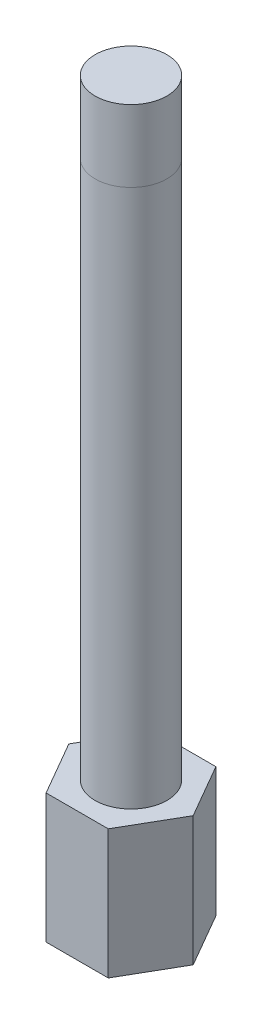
ISO-10303-21;
HEADER;
FILE_DESCRIPTION(('STEP AP214'),'2;1');
FILE_NAME('part.step','',(''),(''),'','','');
FILE_SCHEMA(('AUTOMOTIVE_DESIGN { 1 0 10303 214 1 1 1 1 }'));
ENDSEC;
DATA;
#1=APPLICATION_CONTEXT('core data for automotive mechanical design processes');
#2=APPLICATION_PROTOCOL_DEFINITION('international standard','automotive_design',2000,#1);
#3=PRODUCT_CONTEXT('',#1,'mechanical');
#4=PRODUCT('Part','Part','',(#3));
#5=PRODUCT_RELATED_PRODUCT_CATEGORY('part','',(#4));
#6=PRODUCT_DEFINITION_FORMATION('','',#4);
#7=PRODUCT_DEFINITION_CONTEXT('part definition',#1,'design');
#8=PRODUCT_DEFINITION('design','',#6,#7);
#9=PRODUCT_DEFINITION_SHAPE('','',#8);
#10=(LENGTH_UNIT() NAMED_UNIT(*) SI_UNIT(.MILLI.,.METRE.));
#11=(NAMED_UNIT(*) PLANE_ANGLE_UNIT() SI_UNIT($,.RADIAN.));
#12=(NAMED_UNIT(*) SI_UNIT($,.STERADIAN.) SOLID_ANGLE_UNIT());
#13=UNCERTAINTY_MEASURE_WITH_UNIT(LENGTH_MEASURE(1.E-05),#10,'distance_accuracy_value','');
#14=(GEOMETRIC_REPRESENTATION_CONTEXT(3) GLOBAL_UNCERTAINTY_ASSIGNED_CONTEXT((#13)) GLOBAL_UNIT_ASSIGNED_CONTEXT((#10,
#11,#12)) REPRESENTATION_CONTEXT('',''));
#15=CARTESIAN_POINT('',(0.,0.,0.));
#16=DIRECTION('',(0.,0.,1.));
#17=DIRECTION('',(1.,0.,0.));
#18=AXIS2_PLACEMENT_3D('',#15,#16,#17);
#19=CARTESIAN_POINT('',(0.,103.,0.));
#20=DIRECTION('',(0.,-1.,0.));
#21=DIRECTION('',(0.,0.,-1.));
#22=AXIS2_PLACEMENT_3D('',#19,#20,#21);
#23=CYLINDRICAL_SURFACE('',#22,5.);
#24=CARTESIAN_POINT('',(0.,18.,0.));
#25=DIRECTION('',(0.,1.,0.));
#26=DIRECTION('',(0.,0.,1.));
#27=AXIS2_PLACEMENT_3D('',#24,#25,#26);
#28=CIRCLE('',#27,5.);
#29=CARTESIAN_POINT('',(0.,18.,5.));
#30=VERTEX_POINT('',#29);
#31=EDGE_CURVE('E115',#30,#30,#28,.T.);
#32=ORIENTED_EDGE('',*,*,#31,.T.);
#33=EDGE_LOOP('',(#32));
#34=FACE_BOUND('',#33,.T.);
#35=CARTESIAN_POINT('',(0.,93.,0.));
#36=DIRECTION('',(0.,1.,0.));
#37=DIRECTION('',(0.,0.,1.));
#38=AXIS2_PLACEMENT_3D('',#35,#36,#37);
#39=CIRCLE('',#38,5.);
#40=CARTESIAN_POINT('',(5.,93.,0.));
#41=VERTEX_POINT('',#40);
#42=CARTESIAN_POINT('',(-5.,93.,0.));
#43=VERTEX_POINT('',#42);
#44=EDGE_CURVE('E11',#41,#43,#39,.T.);
#45=ORIENTED_EDGE('',*,*,#44,.F.);
#46=EDGE_CURVE('E40',#43,#41,#39,.T.);
#47=ORIENTED_EDGE('',*,*,#46,.F.);
#48=EDGE_LOOP('',(#45,#47));
#49=FACE_BOUND('',#48,.T.);
#50=ADVANCED_FACE('F36',(#34,#49),#23,.T.);
#51=CARTESIAN_POINT('',(-4.33012701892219,18.,-7.50000000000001));
#52=DIRECTION('',(0.866025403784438,0.,0.5));
#53=DIRECTION('',(0.5,0.,-0.866025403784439));
#54=AXIS2_PLACEMENT_3D('',#51,#52,#53);
#55=PLANE('',#54);
#56=DIRECTION('',(-0.5,0.,0.866025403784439));
#57=VECTOR('',#56,1.);
#58=CARTESIAN_POINT('',(-4.33012701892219,0.,-7.50000000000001));
#59=LINE('',#58,#57);
#60=CARTESIAN_POINT('',(-4.33012701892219,0.,-7.50000000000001));
#61=VERTEX_POINT('',#60);
#62=CARTESIAN_POINT('',(-8.66025403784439,0.,0.));
#63=VERTEX_POINT('',#62);
#64=EDGE_CURVE('E114',#61,#63,#59,.T.);
#65=ORIENTED_EDGE('',*,*,#64,.T.);
#66=DIRECTION('',(0.,-1.,0.));
#67=VECTOR('',#66,1.);
#68=CARTESIAN_POINT('',(-8.66025403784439,18.,0.));
#69=LINE('',#68,#67);
#70=CARTESIAN_POINT('',(-8.66025403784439,18.,0.));
#71=VERTEX_POINT('',#70);
#72=EDGE_CURVE('E95',#71,#63,#69,.T.);
#73=ORIENTED_EDGE('',*,*,#72,.F.);
#74=DIRECTION('',(-0.5,0.,0.866025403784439));
#75=VECTOR('',#74,1.);
#76=CARTESIAN_POINT('',(-4.33012701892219,18.,-7.50000000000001));
#77=LINE('',#76,#75);
#78=CARTESIAN_POINT('',(-4.33012701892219,18.,-7.50000000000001));
#79=VERTEX_POINT('',#78);
#80=EDGE_CURVE('E102',#79,#71,#77,.T.);
#81=ORIENTED_EDGE('',*,*,#80,.F.);
#82=DIRECTION('',(0.,-1.,0.));
#83=VECTOR('',#82,1.);
#84=CARTESIAN_POINT('',(-4.33012701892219,18.,-7.50000000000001));
#85=LINE('',#84,#83);
#86=EDGE_CURVE('E129',#79,#61,#85,.T.);
#87=ORIENTED_EDGE('',*,*,#86,.T.);
#88=EDGE_LOOP('',(#65,#73,#81,#87));
#89=FACE_BOUND('',#88,.T.);
#90=ADVANCED_FACE('F38',(#89),#55,.F.);
#91=CARTESIAN_POINT('',(-8.66025403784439,18.,0.));
#92=DIRECTION('',(0.866025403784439,0.,-0.5));
#93=DIRECTION('',(-0.5,0.,-0.866025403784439));
#94=AXIS2_PLACEMENT_3D('',#91,#92,#93);
#95=PLANE('',#94);
#96=DIRECTION('',(0.5,0.,0.866025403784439));
#97=VECTOR('',#96,1.);
#98=CARTESIAN_POINT('',(-8.66025403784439,0.,0.));
#99=LINE('',#98,#97);
#100=CARTESIAN_POINT('',(-4.33012701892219,0.,7.5));
#101=VERTEX_POINT('',#100);
#102=EDGE_CURVE('E138',#63,#101,#99,.T.);
#103=ORIENTED_EDGE('',*,*,#102,.T.);
#104=DIRECTION('',(0.,-1.,0.));
#105=VECTOR('',#104,1.);
#106=CARTESIAN_POINT('',(-4.33012701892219,18.,7.5));
#107=LINE('',#106,#105);
#108=CARTESIAN_POINT('',(-4.33012701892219,18.,7.5));
#109=VERTEX_POINT('',#108);
#110=EDGE_CURVE('E98',#109,#101,#107,.T.);
#111=ORIENTED_EDGE('',*,*,#110,.F.);
#112=DIRECTION('',(0.5,0.,0.866025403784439));
#113=VECTOR('',#112,1.);
#114=CARTESIAN_POINT('',(-8.66025403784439,18.,0.));
#115=LINE('',#114,#113);
#116=EDGE_CURVE('E91',#71,#109,#115,.T.);
#117=ORIENTED_EDGE('',*,*,#116,.F.);
#118=ORIENTED_EDGE('',*,*,#72,.T.);
#119=EDGE_LOOP('',(#103,#111,#117,#118));
#120=FACE_BOUND('',#119,.T.);
#121=ADVANCED_FACE('F93',(#120),#95,.F.);
#122=CARTESIAN_POINT('',(-4.33012701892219,18.,7.5));
#123=DIRECTION('',(0.,0.,-1.));
#124=DIRECTION('',(-1.,0.,0.));
#125=AXIS2_PLACEMENT_3D('',#122,#123,#124);
#126=PLANE('',#125);
#127=DIRECTION('',(1.,0.,0.));
#128=VECTOR('',#127,1.);
#129=CARTESIAN_POINT('',(-4.33012701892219,0.,7.5));
#130=LINE('',#129,#128);
#131=CARTESIAN_POINT('',(4.3301270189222,0.,7.5));
#132=VERTEX_POINT('',#131);
#133=EDGE_CURVE('E136',#101,#132,#130,.T.);
#134=ORIENTED_EDGE('',*,*,#133,.T.);
#135=DIRECTION('',(0.,-1.,0.));
#136=VECTOR('',#135,1.);
#137=CARTESIAN_POINT('',(4.3301270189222,18.,7.5));
#138=LINE('',#137,#136);
#139=CARTESIAN_POINT('',(4.3301270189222,18.,7.5));
#140=VERTEX_POINT('',#139);
#141=EDGE_CURVE('E118',#140,#132,#138,.T.);
#142=ORIENTED_EDGE('',*,*,#141,.F.);
#143=DIRECTION('',(1.,0.,0.));
#144=VECTOR('',#143,1.);
#145=CARTESIAN_POINT('',(-4.33012701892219,18.,7.5));
#146=LINE('',#145,#144);
#147=EDGE_CURVE('E101',#109,#140,#146,.T.);
#148=ORIENTED_EDGE('',*,*,#147,.F.);
#149=ORIENTED_EDGE('',*,*,#110,.T.);
#150=EDGE_LOOP('',(#134,#142,#148,#149));
#151=FACE_BOUND('',#150,.T.);
#152=ADVANCED_FACE('F187',(#151),#126,.F.);
#153=CARTESIAN_POINT('',(4.3301270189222,18.,7.5));
#154=DIRECTION('',(-0.866025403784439,0.,-0.5));
#155=DIRECTION('',(-0.5,0.,0.866025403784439));
#156=AXIS2_PLACEMENT_3D('',#153,#154,#155);
#157=PLANE('',#156);
#158=DIRECTION('',(0.5,0.,-0.866025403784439));
#159=VECTOR('',#158,1.);
#160=CARTESIAN_POINT('',(4.3301270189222,0.,7.5));
#161=LINE('',#160,#159);
#162=CARTESIAN_POINT('',(8.66025403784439,0.,0.));
#163=VERTEX_POINT('',#162);
#164=EDGE_CURVE('E134',#132,#163,#161,.T.);
#165=ORIENTED_EDGE('',*,*,#164,.T.);
#166=DIRECTION('',(0.,-1.,0.));
#167=VECTOR('',#166,1.);
#168=CARTESIAN_POINT('',(8.66025403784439,18.,0.));
#169=LINE('',#168,#167);
#170=CARTESIAN_POINT('',(8.66025403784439,18.,0.));
#171=VERTEX_POINT('',#170);
#172=EDGE_CURVE('E123',#171,#163,#169,.T.);
#173=ORIENTED_EDGE('',*,*,#172,.F.);
#174=DIRECTION('',(0.5,0.,-0.866025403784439));
#175=VECTOR('',#174,1.);
#176=CARTESIAN_POINT('',(4.3301270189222,18.,7.5));
#177=LINE('',#176,#175);
#178=EDGE_CURVE('E145',#140,#171,#177,.T.);
#179=ORIENTED_EDGE('',*,*,#178,.F.);
#180=ORIENTED_EDGE('',*,*,#141,.T.);
#181=EDGE_LOOP('',(#165,#173,#179,#180));
#182=FACE_BOUND('',#181,.T.);
#183=ADVANCED_FACE('F183',(#182),#157,.F.);
#184=CARTESIAN_POINT('',(8.66025403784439,18.,0.));
#185=DIRECTION('',(-0.866025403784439,0.,0.5));
#186=DIRECTION('',(0.5,0.,0.866025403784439));
#187=AXIS2_PLACEMENT_3D('',#184,#185,#186);
#188=PLANE('',#187);
#189=DIRECTION('',(-0.5,0.,-0.866025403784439));
#190=VECTOR('',#189,1.);
#191=CARTESIAN_POINT('',(8.66025403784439,0.,0.));
#192=LINE('',#191,#190);
#193=CARTESIAN_POINT('',(4.33012701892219,0.,-7.5));
#194=VERTEX_POINT('',#193);
#195=EDGE_CURVE('E132',#163,#194,#192,.T.);
#196=ORIENTED_EDGE('',*,*,#195,.T.);
#197=DIRECTION('',(0.,-1.,0.));
#198=VECTOR('',#197,1.);
#199=CARTESIAN_POINT('',(4.33012701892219,18.,-7.5));
#200=LINE('',#199,#198);
#201=CARTESIAN_POINT('',(4.33012701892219,18.,-7.5));
#202=VERTEX_POINT('',#201);
#203=EDGE_CURVE('E126',#202,#194,#200,.T.);
#204=ORIENTED_EDGE('',*,*,#203,.F.);
#205=DIRECTION('',(-0.5,0.,-0.866025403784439));
#206=VECTOR('',#205,1.);
#207=CARTESIAN_POINT('',(8.66025403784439,18.,0.));
#208=LINE('',#207,#206);
#209=EDGE_CURVE('E143',#171,#202,#208,.T.);
#210=ORIENTED_EDGE('',*,*,#209,.F.);
#211=ORIENTED_EDGE('',*,*,#172,.T.);
#212=EDGE_LOOP('',(#196,#204,#210,#211));
#213=FACE_BOUND('',#212,.T.);
#214=ADVANCED_FACE('F177',(#213),#188,.F.);
#215=CARTESIAN_POINT('',(4.33012701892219,18.,-7.5));
#216=DIRECTION('',(0.,0.,1.));
#217=DIRECTION('',(1.,0.,0.));
#218=AXIS2_PLACEMENT_3D('',#215,#216,#217);
#219=PLANE('',#218);
#220=DIRECTION('',(-1.,0.,0.));
#221=VECTOR('',#220,1.);
#222=CARTESIAN_POINT('',(4.33012701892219,0.,-7.5));
#223=LINE('',#222,#221);
#224=EDGE_CURVE('E111',#194,#61,#223,.T.);
#225=ORIENTED_EDGE('',*,*,#224,.T.);
#226=ORIENTED_EDGE('',*,*,#86,.F.);
#227=DIRECTION('',(-1.,0.,0.));
#228=VECTOR('',#227,1.);
#229=CARTESIAN_POINT('',(4.33012701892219,18.,-7.5));
#230=LINE('',#229,#228);
#231=EDGE_CURVE('E107',#202,#79,#230,.T.);
#232=ORIENTED_EDGE('',*,*,#231,.F.);
#233=ORIENTED_EDGE('',*,*,#203,.T.);
#234=EDGE_LOOP('',(#225,#226,#232,#233));
#235=FACE_BOUND('',#234,.T.);
#236=ADVANCED_FACE('F173',(#235),#219,.F.);
#237=CARTESIAN_POINT('',(0.,18.,0.));
#238=DIRECTION('',(0.,1.,0.));
#239=DIRECTION('',(0.,0.,1.));
#240=AXIS2_PLACEMENT_3D('',#237,#238,#239);
#241=PLANE('',#240);
#242=ORIENTED_EDGE('',*,*,#31,.F.);
#243=EDGE_LOOP('',(#242));
#244=FACE_BOUND('',#243,.T.);
#245=ORIENTED_EDGE('',*,*,#80,.T.);
#246=ORIENTED_EDGE('',*,*,#116,.T.);
#247=ORIENTED_EDGE('',*,*,#147,.T.);
#248=ORIENTED_EDGE('',*,*,#178,.T.);
#249=ORIENTED_EDGE('',*,*,#209,.T.);
#250=ORIENTED_EDGE('',*,*,#231,.T.);
#251=EDGE_LOOP('',(#245,#246,#247,#248,#249,#250));
#252=FACE_BOUND('',#251,.T.);
#253=ADVANCED_FACE('F105',(#244,#252),#241,.T.);
#254=CARTESIAN_POINT('',(0.,0.,0.));
#255=DIRECTION('',(0.,1.,0.));
#256=DIRECTION('',(0.,0.,1.));
#257=AXIS2_PLACEMENT_3D('',#254,#255,#256);
#258=PLANE('',#257);
#259=ORIENTED_EDGE('',*,*,#64,.F.);
#260=ORIENTED_EDGE('',*,*,#224,.F.);
#261=ORIENTED_EDGE('',*,*,#195,.F.);
#262=ORIENTED_EDGE('',*,*,#164,.F.);
#263=ORIENTED_EDGE('',*,*,#133,.F.);
#264=ORIENTED_EDGE('',*,*,#102,.F.);
#265=EDGE_LOOP('',(#259,#260,#261,#262,#263,#264));
#266=FACE_BOUND('',#265,.T.);
#267=ADVANCED_FACE('F155',(#266),#258,.F.);
#268=ORIENTED_EDGE('',*,*,#46,.T.);
#269=ORIENTED_EDGE('',*,*,#44,.T.);
#270=EDGE_LOOP('',(#268,#269));
#271=FACE_BOUND('',#270,.T.);
#272=CARTESIAN_POINT('',(0.,103.,0.));
#273=DIRECTION('',(0.,1.,0.));
#274=DIRECTION('',(0.,0.,1.));
#275=AXIS2_PLACEMENT_3D('',#272,#273,#274);
#276=CIRCLE('',#275,5.);
#277=CARTESIAN_POINT('',(0.,103.,5.));
#278=VERTEX_POINT('',#277);
#279=EDGE_CURVE('E141',#278,#278,#276,.T.);
#280=ORIENTED_EDGE('',*,*,#279,.F.);
#281=EDGE_LOOP('',(#280));
#282=FACE_BOUND('',#281,.T.);
#283=ADVANCED_FACE('F153',(#271,#282),#23,.T.);
#284=CARTESIAN_POINT('',(0.,103.,0.));
#285=DIRECTION('',(0.,1.,0.));
#286=DIRECTION('',(0.,0.,1.));
#287=AXIS2_PLACEMENT_3D('',#284,#285,#286);
#288=PLANE('',#287);
#289=ORIENTED_EDGE('',*,*,#279,.T.);
#290=EDGE_LOOP('',(#289));
#291=FACE_BOUND('',#290,.T.);
#292=ADVANCED_FACE('F151',(#291),#288,.T.);
#293=CLOSED_SHELL('',(#50,#90,#121,#152,#183,#214,#236,#253,#267,#283,#292));
#294=MANIFOLD_SOLID_BREP('B2',#293);
#295=ADVANCED_BREP_SHAPE_REPRESENTATION('',(#18,#294),#14);
#296=SHAPE_DEFINITION_REPRESENTATION(#9,#295);
ENDSEC;
END-ISO-10303-21;
